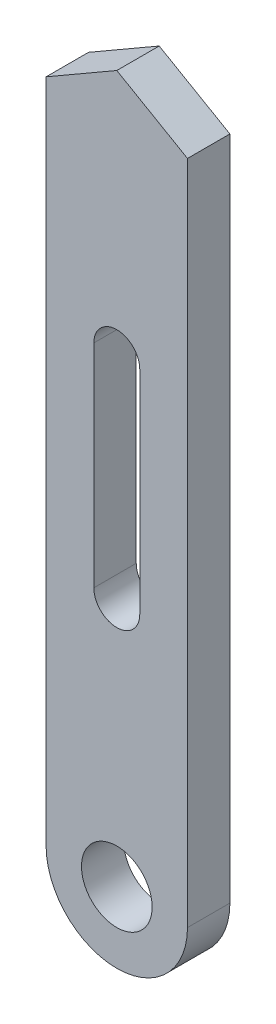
from build123d import *

# Parameters (mm, degrees)
SKETCH1_R      = 5
EXTRUDE1_DEPTH = 6


with BuildPart() as part:
    # Sketch1 → Extrude1 (new body)
    with BuildSketch(Plane.XY):
        with BuildLine():
            Line((10, 0), (10, 94.226497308))
            Line((10, 94.226497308), (0, 100))
            Line((0, 100), (-10, 94.226497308))
            Line((-10, 94.226497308), (-10, 0))
            ThreePointArc((-10, 0), (0, -10), (10, 0))
        make_face()
        Circle(SKETCH1_R, mode=Mode.SUBTRACT)
        with BuildLine():
            Line((3.25, 65), (3.25, 35))
            ThreePointArc((3.25, 35), (0, 31.75), (-3.25, 35))
            Line((-3.25, 35), (-3.25, 65))
            ThreePointArc((-3.25, 65), (0, 68.25), (3.25, 65))
        make_face(mode=Mode.SUBTRACT)
    extrude(amount=EXTRUDE1_DEPTH)


solid = part.part
